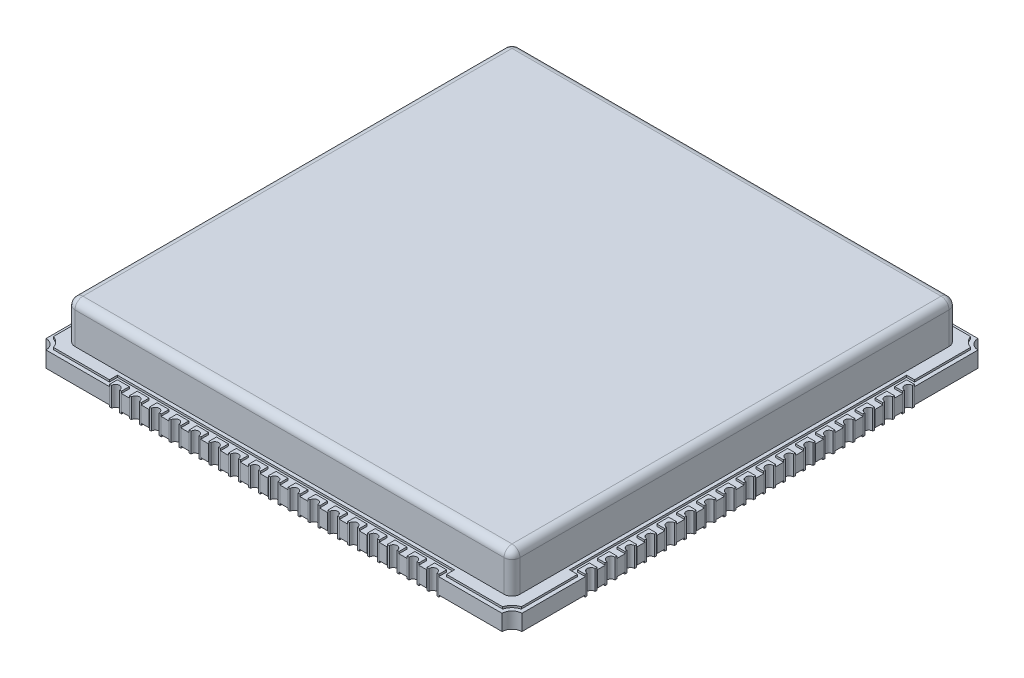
from build123d import *

# Parameters (mm, degrees)
SKETCH_1_W             = 24
SKETCH_1_H             = 24
EXTRUDE_1_DEPTH        = 1
SKETCH_3_R             = 0.5
SKETCH_3_W             = 0.2
SKETCH_3_H             = 0.6
SKETCH_3_W_2           = 0.6
SKETCH_3_H_2           = 0.2
CUT_EXTRUDE_3_DEPTH    = 18
SKETCH_4_OUTSIDE_W     = 32.792
SKETCH_4_OUTSIDE_H     = 32.792
CUT_EXTRUDE_4_DEPTH    = 0.1
SKETCH_5_OUTSIDE_W     = 32.792
SKETCH_5_OUTSIDE_H     = 32.792
SKETCH_5_OUTSIDE_R     = 1.5
SKETCH_5_OUTSIDE_R_2   = 0.75
CUT_EXTRUDE_5_DEPTH    = 0.1
EXTRUDE_7_DEPTH        = 0.3
EXTRUDE_8_DEPTH        = 0.3
PATTERN_LINEAR_1_COUNT = 17
PATTERN_LINEAR_1_PITCH = 1
PATTERN_LINEAR_2_COUNT = 17
PATTERN_LINEAR_2_PITCH = 1
SKETCH_11_R            = 0.2
CUT_EXTRUDE_9_DEPTH    = 18
SKETCH_12_R            = 0.55
SKETCH_12_R_2          = 1.3
EXTRUDE_10_DEPTH       = 0.1
SKETCH_2_W             = 22.44
SKETCH_2_H             = 22.44
EXTRUDE_2_DEPTH        = 2
FILLET_1_R             = 0.4


with BuildPart() as part:
    # Sketch 1 → Extrude 1 (new body)
    with BuildSketch(Plane(origin=(0, 0, 0), x_dir=(1, 0, 0), z_dir=(0, 1, 0))):
        Rectangle(SKETCH_1_W, SKETCH_1_H)
    extrude(amount=EXTRUDE_1_DEPTH)

    # Sketch 3 → Cut-Extrude 3 (cut, through all)
    with BuildSketch(Plane(origin=(0, 1, 0), x_dir=(1, 0, 0), z_dir=(0, 1, 0))):
        with Locations((-12, 12)):
            Circle(SKETCH_3_R)
        with Locations((12, 12)):
            Circle(SKETCH_3_R)
        with Locations((12, -12)):
            Circle(SKETCH_3_R)
        with Locations((-12, -12)):
            Circle(SKETCH_3_R)
        with Locations((-11.9, 8)):
            Rectangle(SKETCH_3_W, SKETCH_3_H)
        with Locations((-8, 11.9)):
            Rectangle(SKETCH_3_W_2, SKETCH_3_H_2)
        with Locations((-7, 11.9)):
            Rectangle(SKETCH_3_W_2, SKETCH_3_H_2)
        with Locations((-6, 11.9)):
            Rectangle(SKETCH_3_W_2, SKETCH_3_H_2)
        with Locations((-5, 11.9)):
            Rectangle(SKETCH_3_W_2, SKETCH_3_H_2)
        with Locations((-4, 11.9)):
            Rectangle(SKETCH_3_W_2, SKETCH_3_H_2)
        with Locations((-3, 11.9)):
            Rectangle(SKETCH_3_W_2, SKETCH_3_H_2)
        with Locations((-2, 11.9)):
            Rectangle(SKETCH_3_W_2, SKETCH_3_H_2)
        with Locations((-1, 11.9)):
            Rectangle(SKETCH_3_W_2, SKETCH_3_H_2)
        with Locations((0, 11.9)):
            Rectangle(SKETCH_3_W_2, SKETCH_3_H_2)
        with Locations((1, 11.9)):
            Rectangle(SKETCH_3_W_2, SKETCH_3_H_2)
        with Locations((2, 11.9)):
            Rectangle(SKETCH_3_W_2, SKETCH_3_H_2)
        with Locations((3, 11.9)):
            Rectangle(SKETCH_3_W_2, SKETCH_3_H_2)
        with Locations((4, 11.9)):
            Rectangle(SKETCH_3_W_2, SKETCH_3_H_2)
        with Locations((5, 11.9)):
            Rectangle(SKETCH_3_W_2, SKETCH_3_H_2)
        with Locations((6, 11.9)):
            Rectangle(SKETCH_3_W_2, SKETCH_3_H_2)
        with Locations((7, 11.9)):
            Rectangle(SKETCH_3_W_2, SKETCH_3_H_2)
        with Locations((8, 11.9)):
            Rectangle(SKETCH_3_W_2, SKETCH_3_H_2)
        with Locations((-8, -11.9)):
            Rectangle(SKETCH_3_W_2, SKETCH_3_H_2)
        with Locations((-7, -11.9)):
            Rectangle(SKETCH_3_W_2, SKETCH_3_H_2)
        with Locations((-6, -11.9)):
            Rectangle(SKETCH_3_W_2, SKETCH_3_H_2)
        with Locations((-5, -11.9)):
            Rectangle(SKETCH_3_W_2, SKETCH_3_H_2)
        with Locations((-4, -11.9)):
            Rectangle(SKETCH_3_W_2, SKETCH_3_H_2)
        with Locations((-3, -11.9)):
            Rectangle(SKETCH_3_W_2, SKETCH_3_H_2)
        with Locations((-2, -11.9)):
            Rectangle(SKETCH_3_W_2, SKETCH_3_H_2)
        with Locations((-1, -11.9)):
            Rectangle(SKETCH_3_W_2, SKETCH_3_H_2)
        with Locations((0, -11.9)):
            Rectangle(SKETCH_3_W_2, SKETCH_3_H_2)
        with Locations((1, -11.9)):
            Rectangle(SKETCH_3_W_2, SKETCH_3_H_2)
        with Locations((2, -11.9)):
            Rectangle(SKETCH_3_W_2, SKETCH_3_H_2)
        with Locations((3, -11.9)):
            Rectangle(SKETCH_3_W_2, SKETCH_3_H_2)
        with Locations((4, -11.9)):
            Rectangle(SKETCH_3_W_2, SKETCH_3_H_2)
        with Locations((5, -11.9)):
            Rectangle(SKETCH_3_W_2, SKETCH_3_H_2)
        with Locations((6, -11.9)):
            Rectangle(SKETCH_3_W_2, SKETCH_3_H_2)
        with Locations((7, -11.9)):
            Rectangle(SKETCH_3_W_2, SKETCH_3_H_2)
        with Locations((8, -11.9)):
            Rectangle(SKETCH_3_W_2, SKETCH_3_H_2)
        with Locations((11.9, 8)):
            Rectangle(SKETCH_3_W, SKETCH_3_H)
        with Locations((-11.9, 7)):
            Rectangle(SKETCH_3_W, SKETCH_3_H)
        with Locations((11.9, 7)):
            Rectangle(SKETCH_3_W, SKETCH_3_H)
        with Locations((-11.9, 6)):
            Rectangle(SKETCH_3_W, SKETCH_3_H)
        with Locations((11.9, 6)):
            Rectangle(SKETCH_3_W, SKETCH_3_H)
        with Locations((-11.9, 5)):
            Rectangle(SKETCH_3_W, SKETCH_3_H)
        with Locations((11.9, 5)):
            Rectangle(SKETCH_3_W, SKETCH_3_H)
        with Locations((-11.9, 4)):
            Rectangle(SKETCH_3_W, SKETCH_3_H)
        with Locations((11.9, 4)):
            Rectangle(SKETCH_3_W, SKETCH_3_H)
        with Locations((-11.9, 3)):
            Rectangle(SKETCH_3_W, SKETCH_3_H)
        with Locations((11.9, 3)):
            Rectangle(SKETCH_3_W, SKETCH_3_H)
        with Locations((-11.9, 2)):
            Rectangle(SKETCH_3_W, SKETCH_3_H)
        with Locations((11.9, 2)):
            Rectangle(SKETCH_3_W, SKETCH_3_H)
        with Locations((-11.9, 1)):
            Rectangle(SKETCH_3_W, SKETCH_3_H)
        with Locations((11.9, 1)):
            Rectangle(SKETCH_3_W, SKETCH_3_H)
        with Locations((-11.9, 0)):
            Rectangle(SKETCH_3_W, SKETCH_3_H)
        with Locations((11.9, 0)):
            Rectangle(SKETCH_3_W, SKETCH_3_H)
        with Locations((-11.9, -1)):
            Rectangle(SKETCH_3_W, SKETCH_3_H)
        with Locations((11.9, -1)):
            Rectangle(SKETCH_3_W, SKETCH_3_H)
        with Locations((-11.9, -2)):
            Rectangle(SKETCH_3_W, SKETCH_3_H)
        with Locations((11.9, -2)):
            Rectangle(SKETCH_3_W, SKETCH_3_H)
        with Locations((-11.9, -3)):
            Rectangle(SKETCH_3_W, SKETCH_3_H)
        with Locations((11.9, -3)):
            Rectangle(SKETCH_3_W, SKETCH_3_H)
        with Locations((-11.9, -4)):
            Rectangle(SKETCH_3_W, SKETCH_3_H)
        with Locations((11.9, -4)):
            Rectangle(SKETCH_3_W, SKETCH_3_H)
        with Locations((-11.9, -5)):
            Rectangle(SKETCH_3_W, SKETCH_3_H)
        with Locations((11.9, -5)):
            Rectangle(SKETCH_3_W, SKETCH_3_H)
        with Locations((-11.9, -6)):
            Rectangle(SKETCH_3_W, SKETCH_3_H)
        with Locations((11.9, -6)):
            Rectangle(SKETCH_3_W, SKETCH_3_H)
        with Locations((-11.9, -7)):
            Rectangle(SKETCH_3_W, SKETCH_3_H)
        with Locations((11.9, -7)):
            Rectangle(SKETCH_3_W, SKETCH_3_H)
        with Locations((-11.9, -8)):
            Rectangle(SKETCH_3_W, SKETCH_3_H)
        with Locations((11.9, -8)):
            Rectangle(SKETCH_3_W, SKETCH_3_H)
    extrude(amount=-CUT_EXTRUDE_3_DEPTH, mode=Mode.SUBTRACT)

    # Sketch 4 outside → Cut-Extrude 4 (cut)
    with BuildSketch(Plane(origin=(0, 1, 0), x_dir=(1, 0, 0), z_dir=(0, 1, 0))):
        Rectangle(SKETCH_4_OUTSIDE_W, SKETCH_4_OUTSIDE_H)
        with BuildLine():
            Line((-11.8, -8.5), (-11.8, -11.329179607))
            ThreePointArc((-11.8, -11.329179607), (-11.505025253, -11.505025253), (-11.329179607, -11.8))
            Line((-11.329179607, -11.8), (-8.5, -11.8))
            Line((-8.5, -11.8), (-8.5, -11.4))
            Line((-8.5, -11.4), (8.5, -11.4))
            Line((8.5, -11.4), (8.5, -11.8))
            Line((8.5, -11.8), (11.329179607, -11.8))
            ThreePointArc((11.329179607, -11.8), (11.505025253, -11.505025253), (11.8, -11.329179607))
            Line((11.8, -11.329179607), (11.8, -8.5))
            Line((11.8, -8.5), (11.4, -8.5))
            Line((11.4, -8.5), (11.4, 8.5))
            Line((11.4, 8.5), (11.8, 8.5))
            Line((11.8, 8.5), (11.8, 11.329179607))
            ThreePointArc((11.8, 11.329179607), (11.505025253, 11.505025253), (11.329179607, 11.8))
            Line((11.329179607, 11.8), (8.5, 11.8))
            Line((8.5, 11.8), (8.5, 11.4))
            Line((8.5, 11.4), (-8.5, 11.4))
            Line((-8.5, 11.4), (-8.5, 11.8))
            Line((-8.5, 11.8), (-11.329179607, 11.8))
            ThreePointArc((-11.329179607, 11.8), (-11.505025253, 11.505025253), (-11.8, 11.329179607))
            Line((-11.8, 11.329179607), (-11.8, 8.5))
            Line((-11.8, 8.5), (-11.4, 8.5))
            Line((-11.4, 8.5), (-11.4, -8.5))
            Line((-11.4, -8.5), (-11.8, -8.5))
        make_face(mode=Mode.SUBTRACT)
    extrude(amount=-CUT_EXTRUDE_4_DEPTH, mode=Mode.SUBTRACT)

    # Sketch 5 outside → Cut-Extrude 5 (cut)
    # profile 1 of 11: a face of its own
    with BuildSketch(Plane.XZ):
        Rectangle(SKETCH_5_OUTSIDE_W, SKETCH_5_OUTSIDE_H)
        with BuildLine():
            Line((-8.5, -10.8), (8.5, -10.8))
            Line((8.5, -10.8), (8.5, -11.8))
            Line((8.5, -11.8), (11.329179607, -11.8))
            ThreePointArc((11.329179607, -11.8), (11.505025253, -11.505025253), (11.8, -11.329179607))
            Line((11.8, -11.329179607), (11.8, -8.5))
            Line((11.8, -8.5), (10.8, -8.5))
            Line((10.8, -8.5), (10.8, 8.5))
            Line((10.8, 8.5), (11.8, 8.5))
            Line((11.8, 8.5), (11.8, 11.329179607))
            ThreePointArc((11.8, 11.329179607), (11.505025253, 11.505025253), (11.329179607, 11.8))
            Line((11.329179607, 11.8), (8.5, 11.8))
            Line((8.5, 11.8), (8.5, 10.8))
            Line((8.5, 10.8), (-8.5, 10.8))
            Line((-8.5, 10.8), (-8.5, 11.8))
            Line((-8.5, 11.8), (-11.329179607, 11.8))
            ThreePointArc((-11.329179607, 11.8), (-11.505025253, 11.505025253), (-11.8, 11.329179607))
            Line((-11.8, 11.329179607), (-11.8, 8.5))
            Line((-11.8, 8.5), (-10.8, 8.5))
            Line((-10.8, 8.5), (-10.8, -8.5))
            Line((-10.8, -8.5), (-11.8, -8.5))
            Line((-11.8, -8.5), (-11.8, -11.329179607))
            ThreePointArc((-11.8, -11.329179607), (-11.505025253, -11.505025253), (-11.329179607, -11.8))
            Line((-11.329179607, -11.8), (-8.5, -11.8))
            Line((-8.5, -11.8), (-8.5, -10.8))
        make_face(mode=Mode.SUBTRACT)
    # profile 2 of 11: a face of its own
    with BuildSketch(Plane.XZ):
        with Locations(Location((-0.5, -8, 0), (0, 0, 270))):
            Circle(SKETCH_5_OUTSIDE_R)
    # profile 3 of 11: a face of its own
    with BuildSketch(Plane.XZ):
        with Locations(Location((-6.5, 2, 0), (0, 0, 270))):
            Circle(SKETCH_5_OUTSIDE_R_2)
    # profile 4 of 11: a face of its own
    with BuildSketch(Plane.XZ):
        with Locations(Location((-4.5, 2, 0), (0, 0, 270))):
            Circle(SKETCH_5_OUTSIDE_R_2)
    # profile 5 of 11: a face of its own
    with BuildSketch(Plane.XZ):
        with Locations(Location((-2.5, 2, 0), (0, 0, 270))):
            Circle(SKETCH_5_OUTSIDE_R_2)
    # profile 6 of 11: a face of its own
    with BuildSketch(Plane.XZ):
        with Locations(Location((-6.5, 0, 0), (0, 0, 270))):
            Circle(SKETCH_5_OUTSIDE_R_2)
    # profile 7 of 11: a face of its own
    with BuildSketch(Plane.XZ):
        with Locations(Location((-4.5, 0, 0), (0, 0, 270))):
            Circle(SKETCH_5_OUTSIDE_R_2)
    # profile 8 of 11: a face of its own
    with BuildSketch(Plane.XZ):
        with Locations(Location((-2.5, 0, 0), (0, 0, 270))):
            Circle(SKETCH_5_OUTSIDE_R_2)
    # profile 9 of 11: a face of its own
    with BuildSketch(Plane.XZ):
        with Locations(Location((-6.5, -2, 0), (0, 0, 270))):
            Circle(SKETCH_5_OUTSIDE_R_2)
    # profile 10 of 11: a face of its own
    with BuildSketch(Plane.XZ):
        with Locations(Location((-4.5, -2, 0), (0, 0, 270))):
            Circle(SKETCH_5_OUTSIDE_R_2)
    # profile 11 of 11: a face of its own
    with BuildSketch(Plane.XZ):
        with Locations(Location((-2.5, -2, 0), (0, 0, 270))):
            Circle(SKETCH_5_OUTSIDE_R_2)
    extrude(amount=-CUT_EXTRUDE_5_DEPTH, mode=Mode.SUBTRACT)

    # Sketch 9 → Extrude 7 (add, symmetric)
    with BuildSketch(Plane.XY.offset(-8)):
        Polygon((-11.99, 1), (-11.99, 0), (-11, 0), (-11, 0.1), (-11.6, 0.1), (-11.6, 1), align=None)
        Polygon((11.6, 1), (11.99, 1), (11.99, 0), (11, 0), (11, 0.1), (11.6, 0.1), align=None)
    extrude_7 = extrude(amount=EXTRUDE_7_DEPTH, both=True)

    # Sketch 10 → Extrude 8 (add, symmetric)
    with BuildSketch(Plane(origin=(-8, 0, 0), x_dir=(0, 0, -1), z_dir=(1, 0, 0))):
        Polygon((11.6, 0.1), (11.6, 1), (11.99, 1), (11.99, 0), (11, 0), (11, 0.1), align=None)
        Polygon((-11, 0.1), (-11.6, 0.1), (-11.6, 1), (-11.99, 1), (-11.99, 0), (-11, 0), align=None)
    extrude_8 = extrude(amount=EXTRUDE_8_DEPTH, both=True)

    # Pattern Linear 1: Extrude 7 ×17
    with Locations(*[(0, 0, i * PATTERN_LINEAR_1_PITCH) for i in range(1, PATTERN_LINEAR_1_COUNT)]):
        add(extrude_7)

    # Pattern Linear 2: Extrude 8 ×17
    with Locations(*[(i * PATTERN_LINEAR_2_PITCH, 0, 0) for i in range(1, PATTERN_LINEAR_2_COUNT)]):
        add(extrude_8)

    # Sketch 11 → Cut-Extrude 9 (cut, through all)
    with BuildSketch(Plane(origin=(0, 1, 0), x_dir=(1, 0, 0), z_dir=(0, 1, 0))):
        with Locations((-11.99, 8)):
            Circle(SKETCH_11_R)
        with Locations((-8, 11.99)):
            Circle(SKETCH_11_R)
        with Locations((11.99, 8)):
            Circle(SKETCH_11_R)
        with Locations((-11.99, 7)):
            Circle(SKETCH_11_R)
        with Locations((11.99, 7)):
            Circle(SKETCH_11_R)
        with Locations((-11.99, 6)):
            Circle(SKETCH_11_R)
        with Locations((11.99, 6)):
            Circle(SKETCH_11_R)
        with Locations((-11.99, 5)):
            Circle(SKETCH_11_R)
        with Locations((11.99, 5)):
            Circle(SKETCH_11_R)
        with Locations((-11.99, 4)):
            Circle(SKETCH_11_R)
        with Locations((11.99, 4)):
            Circle(SKETCH_11_R)
        with Locations((-11.99, 3)):
            Circle(SKETCH_11_R)
        with Locations((11.99, 3)):
            Circle(SKETCH_11_R)
        with Locations((-11.99, 2)):
            Circle(SKETCH_11_R)
        with Locations((11.99, 2)):
            Circle(SKETCH_11_R)
        with Locations((-11.99, 1)):
            Circle(SKETCH_11_R)
        with Locations((11.99, 1)):
            Circle(SKETCH_11_R)
        with Locations((-11.99, 0)):
            Circle(SKETCH_11_R)
        with Locations((11.99, 0)):
            Circle(SKETCH_11_R)
        with Locations((-11.99, -1)):
            Circle(SKETCH_11_R)
        with Locations((11.99, -1)):
            Circle(SKETCH_11_R)
        with Locations((-11.99, -2)):
            Circle(SKETCH_11_R)
        with Locations((11.99, -2)):
            Circle(SKETCH_11_R)
        with Locations((-11.99, -3)):
            Circle(SKETCH_11_R)
        with Locations((11.99, -3)):
            Circle(SKETCH_11_R)
        with Locations((-11.99, -4)):
            Circle(SKETCH_11_R)
        with Locations((11.99, -4)):
            Circle(SKETCH_11_R)
        with Locations((-11.99, -5)):
            Circle(SKETCH_11_R)
        with Locations((11.99, -5)):
            Circle(SKETCH_11_R)
        with Locations((-11.99, -6)):
            Circle(SKETCH_11_R)
        with Locations((11.99, -6)):
            Circle(SKETCH_11_R)
        with Locations((-11.99, -7)):
            Circle(SKETCH_11_R)
        with Locations((11.99, -7)):
            Circle(SKETCH_11_R)
        with Locations((-11.99, -8)):
            Circle(SKETCH_11_R)
        with Locations((11.99, -8)):
            Circle(SKETCH_11_R)
        with Locations((-7, 11.99)):
            Circle(SKETCH_11_R)
        with Locations((-6, 11.99)):
            Circle(SKETCH_11_R)
        with Locations((-5, 11.99)):
            Circle(SKETCH_11_R)
        with Locations((-4, 11.99)):
            Circle(SKETCH_11_R)
        with Locations((-3, 11.99)):
            Circle(SKETCH_11_R)
        with Locations((-2, 11.99)):
            Circle(SKETCH_11_R)
        with Locations((-1, 11.99)):
            Circle(SKETCH_11_R)
        with Locations((0, 11.99)):
            Circle(SKETCH_11_R)
        with Locations((1, 11.99)):
            Circle(SKETCH_11_R)
        with Locations((2, 11.99)):
            Circle(SKETCH_11_R)
        with Locations((3, 11.99)):
            Circle(SKETCH_11_R)
        with Locations((4, 11.99)):
            Circle(SKETCH_11_R)
        with Locations((5, 11.99)):
            Circle(SKETCH_11_R)
        with Locations((6, 11.99)):
            Circle(SKETCH_11_R)
        with Locations((7, 11.99)):
            Circle(SKETCH_11_R)
        with Locations((8, 11.99)):
            Circle(SKETCH_11_R)
        with Locations((-8, -11.99)):
            Circle(SKETCH_11_R)
        with Locations((-7, -11.99)):
            Circle(SKETCH_11_R)
        with Locations((-6, -11.99)):
            Circle(SKETCH_11_R)
        with Locations((-5, -11.99)):
            Circle(SKETCH_11_R)
        with Locations((-4, -11.99)):
            Circle(SKETCH_11_R)
        with Locations((-3, -11.99)):
            Circle(SKETCH_11_R)
        with Locations((-2, -11.99)):
            Circle(SKETCH_11_R)
        with Locations((-1, -11.99)):
            Circle(SKETCH_11_R)
        with Locations((0, -11.99)):
            Circle(SKETCH_11_R)
        with Locations((1, -11.99)):
            Circle(SKETCH_11_R)
        with Locations((2, -11.99)):
            Circle(SKETCH_11_R)
        with Locations((3, -11.99)):
            Circle(SKETCH_11_R)
        with Locations((4, -11.99)):
            Circle(SKETCH_11_R)
        with Locations((5, -11.99)):
            Circle(SKETCH_11_R)
        with Locations((6, -11.99)):
            Circle(SKETCH_11_R)
        with Locations((7, -11.99)):
            Circle(SKETCH_11_R)
        with Locations((8, -11.99)):
            Circle(SKETCH_11_R)
    extrude(amount=-CUT_EXTRUDE_9_DEPTH, mode=Mode.SUBTRACT)

    # Sketch 12 → Extrude 10 (add)
    with BuildSketch(Plane.XZ.offset(-0.1)):
        with Locations(Location((-2.5, 2, 0), (0, 0, 270))):
            Circle(SKETCH_12_R)
        with Locations(Location((-2.5, 0, 0), (0, 0, 270))):
            Circle(SKETCH_12_R)
        with Locations(Location((-4.5, 0, 0), (0, 0, 270))):
            Circle(SKETCH_12_R)
        with Locations(Location((-4.5, 2, 0), (0, 0, 270))):
            Circle(SKETCH_12_R)
        with Locations(Location((-6.5, 2, 0), (0, 0, 270))):
            Circle(SKETCH_12_R)
        with Locations(Location((-6.5, 0, 0), (0, 0, 270))):
            Circle(SKETCH_12_R)
        with Locations(Location((-6.5, -2, 0), (0, 0, 270))):
            Circle(SKETCH_12_R)
        with Locations(Location((-4.5, -2, 0), (0, 0, 270))):
            Circle(SKETCH_12_R)
        with Locations(Location((-2.5, -2, 0), (0, 0, 270))):
            Circle(SKETCH_12_R)
        with Locations(Location((-0.5, -8, 0), (0, 0, 270))):
            Circle(SKETCH_12_R_2)
    extrude(amount=EXTRUDE_10_DEPTH)

    # Sketch 2 → Extrude 2 (add)
    with BuildSketch(Plane(origin=(0, 1, 0), x_dir=(1, 0, 0), z_dir=(0, 1, 0))):
        Rectangle(SKETCH_2_W, SKETCH_2_H)
    extrude(amount=EXTRUDE_2_DEPTH)

    # Fillet 1
    fillet_1_edges = [part.edges().sort_by_distance(p)[0] for p in [
        (-11.22, 2, -11.22),
        (-11.22, 2, 11.22),
        (11.22, 2, 11.22),
        (11.22, 2, -11.22),
        (-11.22, 3, 0),
        (0, 3, 11.22),
        (11.22, 3, 0),
        (0, 3, -11.22),
    ]]
    fillet(fillet_1_edges, radius=FILLET_1_R)


solid = part.part
